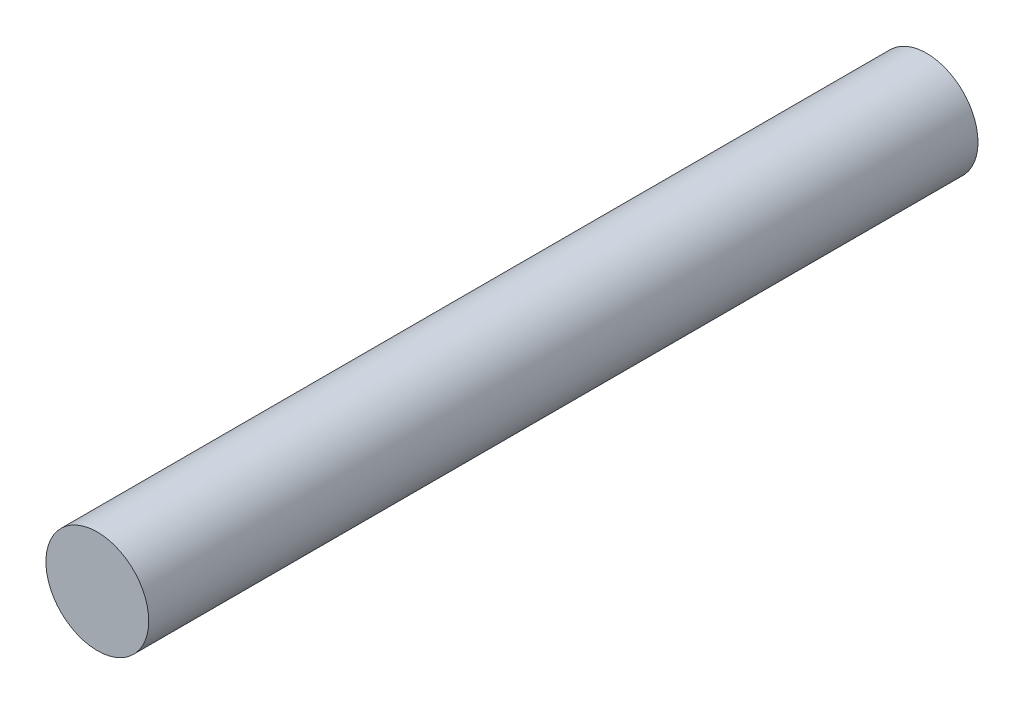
ISO-10303-21;
HEADER;
FILE_DESCRIPTION(('STEP AP214'),'2;1');
FILE_NAME('part.step','',(''),(''),'','','');
FILE_SCHEMA(('AUTOMOTIVE_DESIGN { 1 0 10303 214 1 1 1 1 }'));
ENDSEC;
DATA;
#1=APPLICATION_CONTEXT('core data for automotive mechanical design processes');
#2=APPLICATION_PROTOCOL_DEFINITION('international standard','automotive_design',2000,#1);
#3=PRODUCT_CONTEXT('',#1,'mechanical');
#4=PRODUCT('Part','Part','',(#3));
#5=PRODUCT_RELATED_PRODUCT_CATEGORY('part','',(#4));
#6=PRODUCT_DEFINITION_FORMATION('','',#4);
#7=PRODUCT_DEFINITION_CONTEXT('part definition',#1,'design');
#8=PRODUCT_DEFINITION('design','',#6,#7);
#9=PRODUCT_DEFINITION_SHAPE('','',#8);
#10=(LENGTH_UNIT() NAMED_UNIT(*) SI_UNIT(.MILLI.,.METRE.));
#11=(NAMED_UNIT(*) PLANE_ANGLE_UNIT() SI_UNIT($,.RADIAN.));
#12=(NAMED_UNIT(*) SI_UNIT($,.STERADIAN.) SOLID_ANGLE_UNIT());
#13=UNCERTAINTY_MEASURE_WITH_UNIT(LENGTH_MEASURE(1.E-05),#10,'distance_accuracy_value','');
#14=(GEOMETRIC_REPRESENTATION_CONTEXT(3) GLOBAL_UNCERTAINTY_ASSIGNED_CONTEXT((#13)) GLOBAL_UNIT_ASSIGNED_CONTEXT((#10,
#11,#12)) REPRESENTATION_CONTEXT('',''));
#15=CARTESIAN_POINT('',(0.,0.,0.));
#16=DIRECTION('',(0.,0.,1.));
#17=DIRECTION('',(1.,0.,0.));
#18=AXIS2_PLACEMENT_3D('',#15,#16,#17);
#19=CARTESIAN_POINT('',(0.,0.,12.7));
#20=DIRECTION('',(0.,0.,-1.));
#21=DIRECTION('',(-1.,0.,0.));
#22=AXIS2_PLACEMENT_3D('',#19,#20,#21);
#23=CYLINDRICAL_SURFACE('',#22,0.787400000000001);
#24=CARTESIAN_POINT('',(0.,0.,12.7));
#25=DIRECTION('',(0.,0.,1.));
#26=DIRECTION('',(1.,0.,0.));
#27=AXIS2_PLACEMENT_3D('',#24,#25,#26);
#28=CIRCLE('',#27,0.787400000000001);
#29=CARTESIAN_POINT('',(0.787400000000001,0.,12.7));
#30=VERTEX_POINT('',#29);
#31=EDGE_CURVE('E10',#30,#30,#28,.T.);
#32=ORIENTED_EDGE('',*,*,#31,.F.);
#33=EDGE_LOOP('',(#32));
#34=FACE_BOUND('',#33,.T.);
#35=CARTESIAN_POINT('',(0.,0.,0.));
#36=DIRECTION('',(0.,0.,1.));
#37=DIRECTION('',(1.,0.,0.));
#38=AXIS2_PLACEMENT_3D('',#35,#36,#37);
#39=CIRCLE('',#38,0.787400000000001);
#40=CARTESIAN_POINT('',(0.787400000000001,0.,0.));
#41=VERTEX_POINT('',#40);
#42=EDGE_CURVE('E34',#41,#41,#39,.T.);
#43=ORIENTED_EDGE('',*,*,#42,.T.);
#44=EDGE_LOOP('',(#43));
#45=FACE_BOUND('',#44,.T.);
#46=ADVANCED_FACE('F28',(#34,#45),#23,.T.);
#47=CARTESIAN_POINT('',(0.,0.,12.7));
#48=DIRECTION('',(0.,0.,1.));
#49=DIRECTION('',(1.,0.,0.));
#50=AXIS2_PLACEMENT_3D('',#47,#48,#49);
#51=PLANE('',#50);
#52=ORIENTED_EDGE('',*,*,#31,.T.);
#53=EDGE_LOOP('',(#52));
#54=FACE_BOUND('',#53,.T.);
#55=ADVANCED_FACE('F43',(#54),#51,.T.);
#56=CARTESIAN_POINT('',(0.,0.,0.));
#57=DIRECTION('',(0.,0.,1.));
#58=DIRECTION('',(1.,0.,0.));
#59=AXIS2_PLACEMENT_3D('',#56,#57,#58);
#60=PLANE('',#59);
#61=ORIENTED_EDGE('',*,*,#42,.F.);
#62=EDGE_LOOP('',(#61));
#63=FACE_BOUND('',#62,.T.);
#64=ADVANCED_FACE('F41',(#63),#60,.F.);
#65=CLOSED_SHELL('',(#46,#55,#64));
#66=MANIFOLD_SOLID_BREP('B2',#65);
#67=ADVANCED_BREP_SHAPE_REPRESENTATION('',(#18,#66),#14);
#68=SHAPE_DEFINITION_REPRESENTATION(#9,#67);
ENDSEC;
END-ISO-10303-21;
